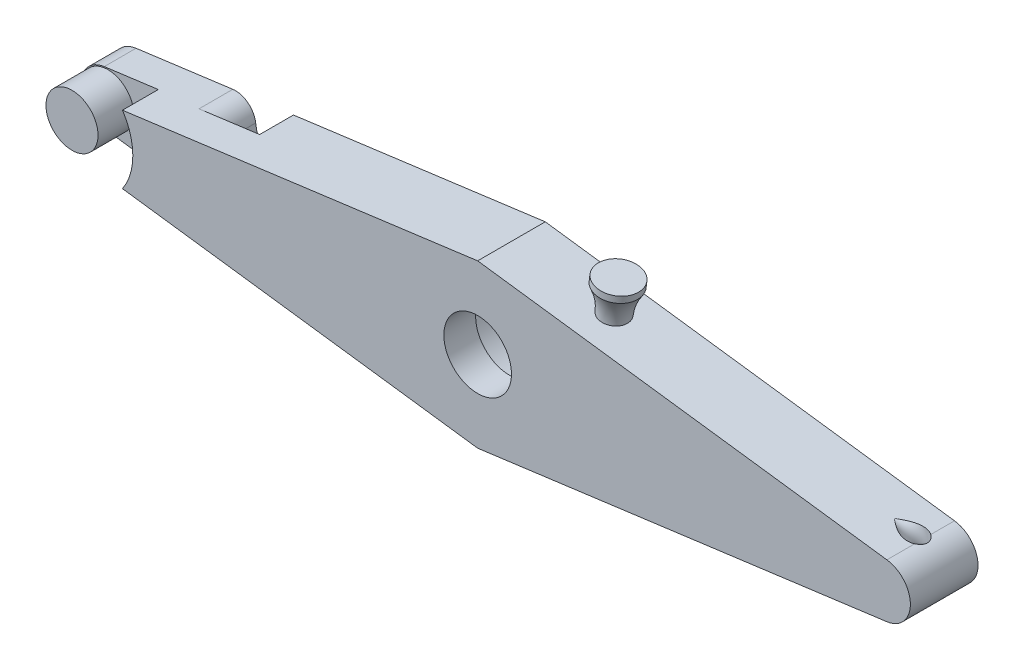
ISO-10303-21;
HEADER;
FILE_DESCRIPTION(('STEP AP214'),'2;1');
FILE_NAME('part.step','',(''),(''),'','','');
FILE_SCHEMA(('AUTOMOTIVE_DESIGN { 1 0 10303 214 1 1 1 1 }'));
ENDSEC;
DATA;
#1=APPLICATION_CONTEXT('core data for automotive mechanical design processes');
#2=APPLICATION_PROTOCOL_DEFINITION('international standard','automotive_design',2000,#1);
#3=PRODUCT_CONTEXT('',#1,'mechanical');
#4=PRODUCT('Part','Part','',(#3));
#5=PRODUCT_RELATED_PRODUCT_CATEGORY('part','',(#4));
#6=PRODUCT_DEFINITION_FORMATION('','',#4);
#7=PRODUCT_DEFINITION_CONTEXT('part definition',#1,'design');
#8=PRODUCT_DEFINITION('design','',#6,#7);
#9=PRODUCT_DEFINITION_SHAPE('','',#8);
#10=(LENGTH_UNIT() NAMED_UNIT(*) SI_UNIT(.MILLI.,.METRE.));
#11=(NAMED_UNIT(*) PLANE_ANGLE_UNIT() SI_UNIT($,.RADIAN.));
#12=(NAMED_UNIT(*) SI_UNIT($,.STERADIAN.) SOLID_ANGLE_UNIT());
#13=UNCERTAINTY_MEASURE_WITH_UNIT(LENGTH_MEASURE(1.E-05),#10,'distance_accuracy_value','');
#14=(GEOMETRIC_REPRESENTATION_CONTEXT(3) GLOBAL_UNCERTAINTY_ASSIGNED_CONTEXT((#13)) GLOBAL_UNIT_ASSIGNED_CONTEXT((#10,
#11,#12)) REPRESENTATION_CONTEXT('',''));
#15=CARTESIAN_POINT('',(0.,0.,0.));
#16=DIRECTION('',(0.,0.,1.));
#17=DIRECTION('',(1.,0.,0.));
#18=AXIS2_PLACEMENT_3D('',#15,#16,#17);
#19=CARTESIAN_POINT('',(60.5263762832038,3.96521474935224,10.));
#20=DIRECTION('',(-0.131594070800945,-0.991303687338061,0.));
#21=DIRECTION('',(0.991303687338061,-0.131594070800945,0.));
#22=AXIS2_PLACEMENT_3D('',#19,#20,#21);
#23=PLANE('',#22);
#24=CARTESIAN_POINT('',(14.8695553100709,10.0260889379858,4.7));
#25=DIRECTION('',(-0.131594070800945,-0.991303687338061,0.));
#26=DIRECTION('',(0.991303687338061,-0.131594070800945,0.));
#27=AXIS2_PLACEMENT_3D('',#24,#25,#26);
#28=CIRCLE('',#27,2.);
#29=CARTESIAN_POINT('',(16.852162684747,9.76290079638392,4.7));
#30=VERTEX_POINT('',#29);
#31=EDGE_CURVE('E268',#30,#30,#28,.T.);
#32=ORIENTED_EDGE('',*,*,#31,.T.);
#33=EDGE_LOOP('',(#32));
#34=FACE_BOUND('',#33,.T.);
#35=CARTESIAN_POINT('',(56.3289851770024,4.52241209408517,4.7));
#36=CARTESIAN_POINT('',(56.3315975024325,4.52206531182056,4.70204123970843));
#37=CARTESIAN_POINT('',(56.334209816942,4.52171853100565,4.70408248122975));
#38=CARTESIAN_POINT('',(56.6134100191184,4.48465512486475,4.92224615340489));
#39=CARTESIAN_POINT('',(56.8899879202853,4.44793982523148,5.13824358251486));
#40=CARTESIAN_POINT('',(57.4657737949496,4.37150511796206,5.53840701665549));
#41=CARTESIAN_POINT('',(57.7648863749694,4.33179837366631,5.72269743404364));
#42=CARTESIAN_POINT('',(58.2179215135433,4.27165864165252,5.93415983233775));
#43=CARTESIAN_POINT('',(58.3578106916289,4.2530885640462,5.99111846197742));
#44=CARTESIAN_POINT('',(58.6438202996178,4.21512121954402,6.08710910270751));
#45=CARTESIAN_POINT('',(58.7899477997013,4.19572301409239,6.12612015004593));
#46=CARTESIAN_POINT('',(59.0884385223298,4.15609882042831,6.18162566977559));
#47=CARTESIAN_POINT('',(59.240854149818,4.13586587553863,6.19785588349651));
#48=CARTESIAN_POINT('',(59.469579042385,4.10550299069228,6.20077538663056));
#49=CARTESIAN_POINT('',(59.54581042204,4.09538338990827,6.19818231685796));
#50=CARTESIAN_POINT('',(59.6976106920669,4.07523213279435,6.18527763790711));
#51=CARTESIAN_POINT('',(59.7731799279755,4.06520043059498,6.17497033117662));
#52=CARTESIAN_POINT('',(59.9483896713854,4.04194160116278,6.14114553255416));
#53=CARTESIAN_POINT('',(60.0474292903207,4.02879424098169,6.11431699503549));
#54=CARTESIAN_POINT('',(60.239772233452,4.00326100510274,6.0448375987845));
#55=CARTESIAN_POINT('',(60.3330892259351,3.99087331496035,6.00222630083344));
#56=CARTESIAN_POINT('',(60.4664698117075,3.9731672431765,5.92621906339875));
#57=CARTESIAN_POINT('',(60.5099356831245,3.96739721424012,5.89878064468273));
#58=CARTESIAN_POINT('',(60.5941369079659,3.95621962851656,5.83992170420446));
#59=CARTESIAN_POINT('',(60.6348729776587,3.95081197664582,5.80850223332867));
#60=CARTESIAN_POINT('',(60.7134721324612,3.94037805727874,5.74149666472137));
#61=CARTESIAN_POINT('',(60.7513057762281,3.93535569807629,5.70587532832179));
#62=CARTESIAN_POINT('',(60.8232152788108,3.92580981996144,5.63088543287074));
#63=CARTESIAN_POINT('',(60.857286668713,3.92128689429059,5.59151251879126));
#64=CARTESIAN_POINT('',(60.8891961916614,3.91705095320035,5.5503996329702));
#65=B_SPLINE_CURVE_WITH_KNOTS('',3,(#35,#36,#37,#38,#39,#40,#41,#42,#43,#44,#45,#46,#47,#48,#49,
#50,#51,#52,#53,#54,#55,#56,#57,#58,#59,#60,#61,#62,#63,#64),.UNSPECIFIED.,.F.,.F.,(4,2,2,2,2,2,
2,2,2,2,2,2,2,2,4),(0.,0.0100000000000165,1.06878515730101,2.12331608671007,2.57887119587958,
3.0349570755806,3.49629103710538,3.72679393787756,3.95716837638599,4.26628399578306,
4.57462997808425,4.72961473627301,4.88455866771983,5.04090932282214,5.19744374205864),.UNSPECIFIED.);
#66=CARTESIAN_POINT('',(56.3289851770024,4.52241209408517,4.7));
#67=VERTEX_POINT('',#66);
#68=CARTESIAN_POINT('',(60.5263762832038,3.96521474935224,5.88692845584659));
#69=VERTEX_POINT('',#68);
#70=EDGE_CURVE('E78',#67,#69,#65,.T.);
#71=ORIENTED_EDGE('',*,*,#70,.F.);
#72=CARTESIAN_POINT('',(56.3289851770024,4.52241209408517,4.7));
#73=CARTESIAN_POINT('',(56.3315975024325,4.52206531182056,4.69795876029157));
#74=CARTESIAN_POINT('',(56.334209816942,4.52171853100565,4.69591751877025));
#75=CARTESIAN_POINT('',(56.6134100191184,4.48465512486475,4.47775384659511));
#76=CARTESIAN_POINT('',(56.8899879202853,4.44793982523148,4.26175641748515));
#77=CARTESIAN_POINT('',(57.4657737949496,4.37150511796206,3.86159298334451));
#78=CARTESIAN_POINT('',(57.7648863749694,4.33179837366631,3.67730256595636));
#79=CARTESIAN_POINT('',(58.2179215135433,4.27165864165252,3.46584016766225));
#80=CARTESIAN_POINT('',(58.3578106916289,4.2530885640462,3.40888153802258));
#81=CARTESIAN_POINT('',(58.6438202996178,4.21512121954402,3.31289089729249));
#82=CARTESIAN_POINT('',(58.7899477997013,4.19572301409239,3.27387984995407));
#83=CARTESIAN_POINT('',(59.0884385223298,4.15609882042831,3.21837433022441));
#84=CARTESIAN_POINT('',(59.240854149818,4.13586587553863,3.20214411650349));
#85=CARTESIAN_POINT('',(59.469579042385,4.10550299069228,3.19922461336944));
#86=CARTESIAN_POINT('',(59.54581042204,4.09538338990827,3.20181768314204));
#87=CARTESIAN_POINT('',(59.6976106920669,4.07523213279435,3.21472236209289));
#88=CARTESIAN_POINT('',(59.7731799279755,4.06520043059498,3.22502966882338));
#89=CARTESIAN_POINT('',(59.9483896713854,4.04194160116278,3.25885446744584));
#90=CARTESIAN_POINT('',(60.0474292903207,4.02879424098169,3.28568300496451));
#91=CARTESIAN_POINT('',(60.239772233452,4.00326100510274,3.3551624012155));
#92=CARTESIAN_POINT('',(60.3330892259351,3.99087331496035,3.39777369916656));
#93=CARTESIAN_POINT('',(60.4664698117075,3.9731672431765,3.47378093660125));
#94=CARTESIAN_POINT('',(60.5099356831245,3.96739721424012,3.50121935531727));
#95=CARTESIAN_POINT('',(60.5941369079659,3.95621962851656,3.56007829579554));
#96=CARTESIAN_POINT('',(60.6348729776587,3.95081197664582,3.59149776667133));
#97=CARTESIAN_POINT('',(60.7134721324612,3.94037805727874,3.65850333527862));
#98=CARTESIAN_POINT('',(60.7513057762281,3.93535569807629,3.69412467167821));
#99=CARTESIAN_POINT('',(60.8232152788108,3.92580981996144,3.76911456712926));
#100=CARTESIAN_POINT('',(60.857286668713,3.92128689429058,3.80848748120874));
#101=CARTESIAN_POINT('',(60.8891961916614,3.91705095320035,3.8496003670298));
#102=B_SPLINE_CURVE_WITH_KNOTS('',3,(#72,#73,#74,#75,#76,#77,#78,#79,#80,#81,#82,#83,#84,#85,
#86,#87,#88,#89,#90,#91,#92,#93,#94,#95,#96,#97,#98,#99,#100,#101),.UNSPECIFIED.,.F.,.F.,(4,2,2,
2,2,2,2,2,2,2,2,2,2,2,4),(0.,0.0100000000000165,1.06878515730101,2.12331608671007,
2.57887119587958,3.0349570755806,3.49629103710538,3.72679393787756,3.95716837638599,
4.26628399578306,4.57462997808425,4.72961473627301,4.88455866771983,5.04090932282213,
5.19744374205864),.UNSPECIFIED.);
#103=CARTESIAN_POINT('',(60.5263762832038,3.96521474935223,3.51307154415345));
#104=VERTEX_POINT('',#103);
#105=EDGE_CURVE('E188',#104,#67,#102,.F.);
#106=ORIENTED_EDGE('',*,*,#105,.F.);
#107=DIRECTION('',(0.,0.,-1.));
#108=VECTOR('',#107,1.);
#109=CARTESIAN_POINT('',(60.5263762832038,3.96521474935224,10.));
#110=LINE('',#109,#108);
#111=CARTESIAN_POINT('',(60.5263762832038,3.96521474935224,0.));
#112=VERTEX_POINT('',#111);
#113=EDGE_CURVE('E512',#104,#112,#110,.T.);
#114=ORIENTED_EDGE('',*,*,#113,.T.);
#115=DIRECTION('',(-0.991303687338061,0.131594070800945,0.));
#116=VECTOR('',#115,1.);
#117=CARTESIAN_POINT('',(60.5263762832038,3.96521474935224,0.));
#118=LINE('',#117,#116);
#119=CARTESIAN_POINT('',(0.,12.,0.));
#120=VERTEX_POINT('',#119);
#121=EDGE_CURVE('E498',#112,#120,#118,.T.);
#122=ORIENTED_EDGE('',*,*,#121,.T.);
#123=DIRECTION('',(0.,0.,-1.));
#124=VECTOR('',#123,1.);
#125=CARTESIAN_POINT('',(0.,12.,10.));
#126=LINE('',#125,#124);
#127=CARTESIAN_POINT('',(0.,12.,10.));
#128=VERTEX_POINT('',#127);
#129=EDGE_CURVE('E542',#128,#120,#126,.T.);
#130=ORIENTED_EDGE('',*,*,#129,.F.);
#131=DIRECTION('',(-0.991303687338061,0.131594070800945,0.));
#132=VECTOR('',#131,1.);
#133=CARTESIAN_POINT('',(60.5263762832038,3.96521474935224,10.));
#134=LINE('',#133,#132);
#135=CARTESIAN_POINT('',(60.5263762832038,3.96521474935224,10.));
#136=VERTEX_POINT('',#135);
#137=EDGE_CURVE('E500',#136,#128,#134,.T.);
#138=ORIENTED_EDGE('',*,*,#137,.F.);
#139=EDGE_CURVE('E197',#136,#69,#110,.T.);
#140=ORIENTED_EDGE('',*,*,#139,.T.);
#141=EDGE_LOOP('',(#71,#106,#114,#122,#130,#138,#140));
#142=FACE_BOUND('',#141,.T.);
#143=ADVANCED_FACE('F51',(#34,#142),#23,.F.);
#144=CARTESIAN_POINT('',(60.,0.,10.));
#145=DIRECTION('',(0.,0.,-1.));
#146=DIRECTION('',(-1.,0.,0.));
#147=AXIS2_PLACEMENT_3D('',#144,#145,#146);
#148=CYLINDRICAL_SURFACE('',#147,4.);
#149=CARTESIAN_POINT('',(60.5263762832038,-3.96521474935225,3.29539044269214));
#150=CARTESIAN_POINT('',(60.5663465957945,-3.95991136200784,3.31036954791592));
#151=CARTESIAN_POINT('',(60.6055919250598,-3.95408352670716,3.32702300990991));
#152=CARTESIAN_POINT('',(60.6824005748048,-3.94155294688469,3.36353510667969));
#153=CARTESIAN_POINT('',(60.7199644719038,-3.93485050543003,3.38339263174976));
#154=CARTESIAN_POINT('',(60.8296665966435,-3.9137168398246,3.44747977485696));
#155=CARTESIAN_POINT('',(60.8989921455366,-3.89823454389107,3.4962907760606));
#156=CARTESIAN_POINT('',(61.0282277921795,-3.86616004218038,3.60461738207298));
#157=CARTESIAN_POINT('',(61.0881452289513,-3.84956871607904,3.6641245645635));
#158=CARTESIAN_POINT('',(61.1972786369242,-3.81703664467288,3.79246663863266));
#159=CARTESIAN_POINT('',(61.2464909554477,-3.80109612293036,3.86130470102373));
#160=CARTESIAN_POINT('',(61.3335931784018,-3.77143098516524,4.00795430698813));
#161=CARTESIAN_POINT('',(61.371270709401,-3.75774985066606,4.08590138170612));
#162=CARTESIAN_POINT('',(61.4327866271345,-3.73473054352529,4.24767353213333));
#163=CARTESIAN_POINT('',(61.4566324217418,-3.72539004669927,4.33149543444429));
#164=CARTESIAN_POINT('',(61.4886169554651,-3.71272171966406,4.49795500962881));
#165=CARTESIAN_POINT('',(61.4975127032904,-3.70910468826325,4.58042490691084));
#166=CARTESIAN_POINT('',(61.5015787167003,-3.70746127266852,4.74574652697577));
#167=CARTESIAN_POINT('',(61.4967529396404,-3.70943327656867,4.82859813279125));
#168=CARTESIAN_POINT('',(61.4741965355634,-3.71845071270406,4.98790649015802));
#169=CARTESIAN_POINT('',(61.4571329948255,-3.72523369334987,5.06447443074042));
#170=CARTESIAN_POINT('',(61.411486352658,-3.74276624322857,5.21360474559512));
#171=CARTESIAN_POINT('',(61.3829017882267,-3.75351631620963,5.28616660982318));
#172=CARTESIAN_POINT('',(61.3139711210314,-3.7782084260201,5.42794272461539));
#173=CARTESIAN_POINT('',(61.2732647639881,-3.79224490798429,5.49696479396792));
#174=CARTESIAN_POINT('',(61.1815689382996,-3.82180733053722,5.62750367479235));
#175=CARTESIAN_POINT('',(61.1305715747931,-3.83733440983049,5.6890146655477));
#176=CARTESIAN_POINT('',(61.0158227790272,-3.8693513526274,5.80693833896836));
#177=CARTESIAN_POINT('',(60.951454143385,-3.88583755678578,5.86275187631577));
#178=CARTESIAN_POINT('',(60.8139706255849,-3.91693602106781,5.96279455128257));
#179=CARTESIAN_POINT('',(60.7408729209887,-3.93155184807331,6.00704591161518));
#180=CARTESIAN_POINT('',(60.6419479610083,-3.94821827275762,6.05592556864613));
#181=CARTESIAN_POINT('',(60.6191911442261,-3.95185359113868,6.06646766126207));
#182=CARTESIAN_POINT('',(60.5731650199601,-3.95879030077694,6.08640116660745));
#183=CARTESIAN_POINT('',(60.5498964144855,-3.96209211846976,6.09579405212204));
#184=CARTESIAN_POINT('',(60.5263762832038,-3.96521474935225,6.10460955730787));
#185=B_SPLINE_CURVE_WITH_KNOTS('',3,(#149,#150,#151,#152,#153,#154,#155,#156,#157,#158,#159,
#160,#161,#162,#163,#164,#165,#166,#167,#168,#169,#170,#171,#172,#173,#174,#175,#176,#177,#178,
#179,#180,#181,#182,#183,#184),.UNSPECIFIED.,.F.,.F.,(4,2,2,2,2,2,2,2,2,2,2,2,2,2,2,2,2,4),(0.,
0.128949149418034,0.257853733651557,0.515098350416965,0.772141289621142,1.02927179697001,
1.29088552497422,1.55235901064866,1.80014249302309,2.04785452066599,2.28300004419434,
2.51817543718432,2.76118914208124,3.0043899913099,3.26354467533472,3.52219753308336,
3.59820057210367,3.67410516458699),.UNSPECIFIED.);
#186=CARTESIAN_POINT('',(60.5263762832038,-3.96521474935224,3.29539044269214));
#187=VERTEX_POINT('',#186);
#188=CARTESIAN_POINT('',(60.5263762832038,-3.96521474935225,6.10460955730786));
#189=VERTEX_POINT('',#188);
#190=EDGE_CURVE('E12',#187,#189,#185,.T.);
#191=ORIENTED_EDGE('',*,*,#190,.F.);
#192=DIRECTION('',(0.,0.,-1.));
#193=VECTOR('',#192,1.);
#194=CARTESIAN_POINT('',(60.5263762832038,-3.96521474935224,10.));
#195=LINE('',#194,#193);
#196=CARTESIAN_POINT('',(60.5263762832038,-3.96521474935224,0.));
#197=VERTEX_POINT('',#196);
#198=EDGE_CURVE('E530',#187,#197,#195,.T.);
#199=ORIENTED_EDGE('',*,*,#198,.T.);
#200=CARTESIAN_POINT('',(60.,0.,0.));
#201=DIRECTION('',(0.,0.,1.));
#202=DIRECTION('',(1.,0.,0.));
#203=AXIS2_PLACEMENT_3D('',#200,#201,#202);
#204=CIRCLE('',#203,4.);
#205=EDGE_CURVE('E504',#197,#112,#204,.T.);
#206=ORIENTED_EDGE('',*,*,#205,.T.);
#207=ORIENTED_EDGE('',*,*,#113,.F.);
#208=CARTESIAN_POINT('',(60.5261762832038,3.96524129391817,5.88706268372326));
#209=CARTESIAN_POINT('',(60.5635774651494,3.96028020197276,5.86195917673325));
#210=CARTESIAN_POINT('',(60.5999809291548,3.95490860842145,5.83548141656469));
#211=CARTESIAN_POINT('',(60.6705733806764,3.94355274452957,5.77980284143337));
#212=CARTESIAN_POINT('',(60.7047610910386,3.93756812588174,5.75060047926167));
#213=CARTESIAN_POINT('',(60.8041442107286,3.91891653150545,5.65849415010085));
#214=CARTESIAN_POINT('',(60.8655436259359,3.90563927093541,5.59149989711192));
#215=CARTESIAN_POINT('',(60.9758304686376,3.87956089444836,5.44730057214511));
#216=CARTESIAN_POINT('',(61.0246635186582,3.86676204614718,5.37005324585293));
#217=CARTESIAN_POINT('',(61.106411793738,3.84417290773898,5.20738816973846));
#218=CARTESIAN_POINT('',(61.1393925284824,3.83437029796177,5.12200582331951));
#219=CARTESIAN_POINT('',(61.1838225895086,3.82086845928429,4.95740716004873));
#220=CARTESIAN_POINT('',(61.1975322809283,3.81653633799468,4.87885557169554));
#221=CARTESIAN_POINT('',(61.2100016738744,3.81260386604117,4.7204235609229));
#222=CARTESIAN_POINT('',(61.2087642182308,3.8130026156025,4.64054339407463));
#223=CARTESIAN_POINT('',(61.1926244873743,3.81807453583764,4.49321570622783));
#224=CARTESIAN_POINT('',(61.1795722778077,3.82216878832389,4.42553446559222));
#225=CARTESIAN_POINT('',(61.1431324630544,3.83322425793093,4.29330008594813));
#226=CARTESIAN_POINT('',(61.1197464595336,3.84018503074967,4.22874646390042));
#227=CARTESIAN_POINT('',(61.0626209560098,3.85639039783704,4.1014915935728));
#228=CARTESIAN_POINT('',(61.0284946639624,3.86571725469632,4.03897617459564));
#229=CARTESIAN_POINT('',(60.9516243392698,3.8853554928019,3.91959359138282));
#230=CARTESIAN_POINT('',(60.9088688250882,3.89566817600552,3.86273410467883));
#231=CARTESIAN_POINT('',(60.8135162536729,3.91671908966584,3.75232325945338));
#232=CARTESIAN_POINT('',(60.7605048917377,3.92744920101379,3.69913025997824));
#233=CARTESIAN_POINT('',(60.6479325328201,3.94759389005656,3.60032758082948));
#234=CARTESIAN_POINT('',(60.5883950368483,3.95701292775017,3.5546920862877));
#235=CARTESIAN_POINT('',(60.5261762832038,3.96524129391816,3.51293731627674));
#236=B_SPLINE_CURVE_WITH_KNOTS('',3,(#208,#209,#210,#211,#212,#213,#214,#215,#216,#217,#218,
#219,#220,#221,#222,#223,#224,#225,#226,#227,#228,#229,#230,#231,#232,#233,#234,#235),
.UNSPECIFIED.,.F.,.F.,(4,2,2,2,2,2,2,2,2,2,2,2,2,4),(0.,0.135880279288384,0.27183819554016,
0.545962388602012,0.821253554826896,1.09539708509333,1.33350574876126,1.57156912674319,
1.77778712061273,1.9839731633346,2.1986522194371,2.4136188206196,2.64050749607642,
2.86660442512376),.UNSPECIFIED.);
#237=EDGE_CURVE('E65',#69,#104,#236,.T.);
#238=ORIENTED_EDGE('',*,*,#237,.F.);
#239=ORIENTED_EDGE('',*,*,#139,.F.);
#240=CARTESIAN_POINT('',(60.,0.,10.));
#241=DIRECTION('',(0.,0.,1.));
#242=DIRECTION('',(1.,0.,0.));
#243=AXIS2_PLACEMENT_3D('',#240,#241,#242);
#244=CIRCLE('',#243,4.);
#245=CARTESIAN_POINT('',(60.5263762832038,-3.96521474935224,10.));
#246=VERTEX_POINT('',#245);
#247=EDGE_CURVE('E510',#246,#136,#244,.T.);
#248=ORIENTED_EDGE('',*,*,#247,.F.);
#249=EDGE_CURVE('E531',#246,#189,#195,.T.);
#250=ORIENTED_EDGE('',*,*,#249,.T.);
#251=EDGE_LOOP('',(#191,#199,#206,#207,#238,#239,#248,#250));
#252=FACE_BOUND('',#251,.T.);
#253=ADVANCED_FACE('F232',(#252),#148,.T.);
#254=CARTESIAN_POINT('',(-60.,0.,0.));
#255=DIRECTION('',(0.,0.,1.));
#256=DIRECTION('',(1.,0.,0.));
#257=AXIS2_PLACEMENT_3D('',#254,#255,#256);
#258=PLANE('',#257);
#259=CARTESIAN_POINT('',(0.,0.,0.));
#260=DIRECTION('',(0.,0.,1.));
#261=DIRECTION('',(1.,0.,0.));
#262=AXIS2_PLACEMENT_3D('',#259,#260,#261);
#263=CIRCLE('',#262,8.1);
#264=CARTESIAN_POINT('',(8.1,0.,0.));
#265=VERTEX_POINT('',#264);
#266=EDGE_CURVE('E485',#265,#265,#263,.T.);
#267=ORIENTED_EDGE('',*,*,#266,.T.);
#268=EDGE_LOOP('',(#267));
#269=FACE_BOUND('',#268,.T.);
#270=DIRECTION('',(-0.991303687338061,-0.131594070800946,0.));
#271=VECTOR('',#270,1.);
#272=CARTESIAN_POINT('',(0.,12.,0.));
#273=LINE('',#272,#271);
#274=CARTESIAN_POINT('',(-46.2107498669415,5.86559258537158,0.));
#275=VERTEX_POINT('',#274);
#276=CARTESIAN_POINT('',(-60.5263762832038,3.96521474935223,0.));
#277=VERTEX_POINT('',#276);
#278=EDGE_CURVE('E515',#275,#277,#273,.T.);
#279=ORIENTED_EDGE('',*,*,#278,.F.);
#280=CARTESIAN_POINT('',(-45.8159676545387,2.89168152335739,0.));
#281=DIRECTION('',(0.,0.,1.));
#282=DIRECTION('',(1.,0.,0.));
#283=AXIS2_PLACEMENT_3D('',#280,#281,#282);
#284=CIRCLE('',#283,3.);
#285=CARTESIAN_POINT('',(-42.8360277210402,3.23803104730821,0.));
#286=VERTEX_POINT('',#285);
#287=EDGE_CURVE('E551',#275,#286,#284,.F.);
#288=ORIENTED_EDGE('',*,*,#287,.T.);
#289=CARTESIAN_POINT('',(-36.2801598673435,4.,0.));
#290=DIRECTION('',(0.,0.,-1.));
#291=DIRECTION('',(-1.,0.,0.));
#292=AXIS2_PLACEMENT_3D('',#289,#290,#291);
#293=CIRCLE('',#292,6.59999999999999);
#294=CARTESIAN_POINT('',(-36.2801598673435,-2.59999999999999,0.));
#295=VERTEX_POINT('',#294);
#296=EDGE_CURVE('E616',#295,#286,#293,.T.);
#297=ORIENTED_EDGE('',*,*,#296,.F.);
#298=DIRECTION('',(-1.,0.,0.));
#299=VECTOR('',#298,1.);
#300=CARTESIAN_POINT('',(-30.2801598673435,-2.6,0.));
#301=LINE('',#300,#299);
#302=CARTESIAN_POINT('',(-30.2801598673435,-2.6,0.));
#303=VERTEX_POINT('',#302);
#304=EDGE_CURVE('E618',#303,#295,#301,.T.);
#305=ORIENTED_EDGE('',*,*,#304,.F.);
#306=CARTESIAN_POINT('',(-30.2801598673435,0.,0.));
#307=DIRECTION('',(0.,0.,-1.));
#308=DIRECTION('',(-1.,0.,0.));
#309=AXIS2_PLACEMENT_3D('',#306,#307,#308);
#310=CIRCLE('',#309,2.6);
#311=CARTESIAN_POINT('',(-30.2801598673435,2.6,0.));
#312=VERTEX_POINT('',#311);
#313=EDGE_CURVE('E621',#312,#303,#310,.T.);
#314=ORIENTED_EDGE('',*,*,#313,.F.);
#315=DIRECTION('',(1.,0.,0.));
#316=VECTOR('',#315,1.);
#317=CARTESIAN_POINT('',(-30.2801598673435,2.6,0.));
#318=LINE('',#317,#316);
#319=CARTESIAN_POINT('',(-36.2801598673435,2.6,0.));
#320=VERTEX_POINT('',#319);
#321=EDGE_CURVE('E624',#320,#312,#318,.T.);
#322=ORIENTED_EDGE('',*,*,#321,.F.);
#323=CARTESIAN_POINT('',(-36.2801598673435,4.,0.));
#324=DIRECTION('',(0.,0.,1.));
#325=DIRECTION('',(-1.,0.,0.));
#326=AXIS2_PLACEMENT_3D('',#323,#324,#325);
#327=CIRCLE('',#326,1.4);
#328=CARTESIAN_POINT('',(-37.6717276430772,4.15342465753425,0.));
#329=VERTEX_POINT('',#328);
#330=EDGE_CURVE('E627',#329,#320,#327,.T.);
#331=ORIENTED_EDGE('',*,*,#330,.F.);
#332=CARTESIAN_POINT('',(0.,0.,0.));
#333=DIRECTION('',(0.,0.,1.));
#334=DIRECTION('',(1.,0.,0.));
#335=AXIS2_PLACEMENT_3D('',#332,#333,#334);
#336=CIRCLE('',#335,37.9);
#337=CARTESIAN_POINT('',(-37.3781415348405,6.26773766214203,0.));
#338=VERTEX_POINT('',#337);
#339=EDGE_CURVE('E199',#338,#329,#336,.T.);
#340=ORIENTED_EDGE('',*,*,#339,.F.);
#341=DIRECTION('',(-0.165375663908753,-0.98623064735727,0.));
#342=VECTOR('',#341,1.);
#343=CARTESIAN_POINT('',(-37.3781415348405,6.26773766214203,0.));
#344=LINE('',#343,#342);
#345=CARTESIAN_POINT('',(-37.2460213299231,7.05564679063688,0.));
#346=VERTEX_POINT('',#345);
#347=EDGE_CURVE('E612',#346,#338,#344,.T.);
#348=ORIENTED_EDGE('',*,*,#347,.F.);
#349=EDGE_CURVE('E516',#120,#346,#273,.T.);
#350=ORIENTED_EDGE('',*,*,#349,.F.);
#351=ORIENTED_EDGE('',*,*,#121,.F.);
#352=ORIENTED_EDGE('',*,*,#205,.F.);
#353=DIRECTION('',(0.991303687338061,0.131594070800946,0.));
#354=VECTOR('',#353,1.);
#355=CARTESIAN_POINT('',(0.,-12.,0.));
#356=LINE('',#355,#354);
#357=CARTESIAN_POINT('',(0.,-12.,0.));
#358=VERTEX_POINT('',#357);
#359=EDGE_CURVE('E524',#358,#197,#356,.T.);
#360=ORIENTED_EDGE('',*,*,#359,.F.);
#361=DIRECTION('',(0.991303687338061,-0.131594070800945,0.));
#362=VECTOR('',#361,1.);
#363=CARTESIAN_POINT('',(-60.5263762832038,-3.96521474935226,0.));
#364=LINE('',#363,#362);
#365=CARTESIAN_POINT('',(-60.5263762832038,-3.96521474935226,0.));
#366=VERTEX_POINT('',#365);
#367=EDGE_CURVE('E522',#366,#358,#364,.T.);
#368=ORIENTED_EDGE('',*,*,#367,.F.);
#369=CARTESIAN_POINT('',(-60.,0.,0.));
#370=DIRECTION('',(0.,0.,1.));
#371=DIRECTION('',(1.,0.,0.));
#372=AXIS2_PLACEMENT_3D('',#369,#370,#371);
#373=CIRCLE('',#372,4.);
#374=EDGE_CURVE('E519',#277,#366,#373,.T.);
#375=ORIENTED_EDGE('',*,*,#374,.F.);
#376=EDGE_LOOP('',(#279,#288,#297,#305,#314,#322,#331,#340,#348,#350,#351,#352,#360,#368,#375));
#377=FACE_BOUND('',#376,.T.);
#378=ADVANCED_FACE('F237',(#269,#377),#258,.F.);
#379=CARTESIAN_POINT('',(-60.,0.,10.));
#380=DIRECTION('',(0.,0.,-1.));
#381=DIRECTION('',(-1.,0.,0.));
#382=AXIS2_PLACEMENT_3D('',#379,#380,#381);
#383=CYLINDRICAL_SURFACE('',#382,4.);
#384=CARTESIAN_POINT('',(-60.,0.,4.7));
#385=DIRECTION('',(0.,0.,1.));
#386=DIRECTION('',(1.,0.,0.));
#387=AXIS2_PLACEMENT_3D('',#384,#385,#386);
#388=CIRCLE('',#387,4.);
#389=CARTESIAN_POINT('',(-60.5263762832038,3.96521474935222,4.7));
#390=VERTEX_POINT('',#389);
#391=CARTESIAN_POINT('',(-60.5263762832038,-3.96521474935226,4.7));
#392=VERTEX_POINT('',#391);
#393=EDGE_CURVE('E576',#390,#392,#388,.T.);
#394=ORIENTED_EDGE('',*,*,#393,.F.);
#395=DIRECTION('',(0.,0.,-1.));
#396=VECTOR('',#395,1.);
#397=CARTESIAN_POINT('',(-60.5263762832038,3.96521474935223,10.));
#398=LINE('',#397,#396);
#399=EDGE_CURVE('E539',#390,#277,#398,.T.);
#400=ORIENTED_EDGE('',*,*,#399,.T.);
#401=ORIENTED_EDGE('',*,*,#374,.T.);
#402=DIRECTION('',(0.,0.,-1.));
#403=VECTOR('',#402,1.);
#404=CARTESIAN_POINT('',(-60.5263762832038,-3.96521474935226,10.));
#405=LINE('',#404,#403);
#406=EDGE_CURVE('E537',#392,#366,#405,.T.);
#407=ORIENTED_EDGE('',*,*,#406,.F.);
#408=EDGE_LOOP('',(#394,#400,#401,#407));
#409=FACE_BOUND('',#408,.T.);
#410=ADVANCED_FACE('F251',(#409),#383,.T.);
#411=CARTESIAN_POINT('',(0.,12.,10.));
#412=DIRECTION('',(0.131594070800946,-0.991303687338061,0.));
#413=DIRECTION('',(0.991303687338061,0.131594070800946,0.));
#414=AXIS2_PLACEMENT_3D('',#411,#412,#413);
#415=PLANE('',#414);
#416=DIRECTION('',(0.991303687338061,0.131594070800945,0.));
#417=VECTOR('',#416,1.);
#418=CARTESIAN_POINT('',(-37.2460213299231,7.05564679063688,5.));
#419=LINE('',#418,#417);
#420=CARTESIAN_POINT('',(-46.2107498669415,5.86559258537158,5.));
#421=VERTEX_POINT('',#420);
#422=CARTESIAN_POINT('',(-37.2460213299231,7.05564679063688,5.));
#423=VERTEX_POINT('',#422);
#424=EDGE_CURVE('E562',#421,#423,#419,.T.);
#425=ORIENTED_EDGE('',*,*,#424,.F.);
#426=DIRECTION('',(0.,0.,-1.));
#427=VECTOR('',#426,1.);
#428=CARTESIAN_POINT('',(-46.2107498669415,5.86559258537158,10.));
#429=LINE('',#428,#427);
#430=EDGE_CURVE('E548',#421,#275,#429,.T.);
#431=ORIENTED_EDGE('',*,*,#430,.T.);
#432=ORIENTED_EDGE('',*,*,#278,.T.);
#433=ORIENTED_EDGE('',*,*,#399,.F.);
#434=DIRECTION('',(-0.991303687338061,-0.131594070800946,0.));
#435=VECTOR('',#434,1.);
#436=CARTESIAN_POINT('',(0.,12.,4.7));
#437=LINE('',#436,#435);
#438=CARTESIAN_POINT('',(-52.5342304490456,5.0261600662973,4.7));
#439=VERTEX_POINT('',#438);
#440=EDGE_CURVE('E492',#439,#390,#437,.T.);
#441=ORIENTED_EDGE('',*,*,#440,.F.);
#442=DIRECTION('',(0.,0.,1.));
#443=VECTOR('',#442,1.);
#444=CARTESIAN_POINT('',(-52.5342304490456,5.0261600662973,4.7));
#445=LINE('',#444,#443);
#446=CARTESIAN_POINT('',(-52.5342304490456,5.0261600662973,10.));
#447=VERTEX_POINT('',#446);
#448=EDGE_CURVE('E579',#439,#447,#445,.T.);
#449=ORIENTED_EDGE('',*,*,#448,.T.);
#450=DIRECTION('',(-0.991303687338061,-0.131594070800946,0.));
#451=VECTOR('',#450,1.);
#452=CARTESIAN_POINT('',(0.,12.,10.));
#453=LINE('',#452,#451);
#454=EDGE_CURVE('E503',#128,#447,#453,.T.);
#455=ORIENTED_EDGE('',*,*,#454,.F.);
#456=ORIENTED_EDGE('',*,*,#129,.T.);
#457=ORIENTED_EDGE('',*,*,#349,.T.);
#458=DIRECTION('',(0.,0.,-1.));
#459=VECTOR('',#458,1.);
#460=CARTESIAN_POINT('',(-37.2460213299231,7.05564679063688,5.));
#461=LINE('',#460,#459);
#462=EDGE_CURVE('E609',#423,#346,#461,.T.);
#463=ORIENTED_EDGE('',*,*,#462,.F.);
#464=EDGE_LOOP('',(#425,#431,#432,#433,#441,#449,#455,#456,#457,#463));
#465=FACE_BOUND('',#464,.T.);
#466=ADVANCED_FACE('F249',(#465),#415,.F.);
#467=CARTESIAN_POINT('',(-60.5263762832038,-3.96521474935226,10.));
#468=DIRECTION('',(0.131594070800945,0.991303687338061,0.));
#469=DIRECTION('',(-0.991303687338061,0.131594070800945,0.));
#470=AXIS2_PLACEMENT_3D('',#467,#468,#469);
#471=PLANE('',#470);
#472=DIRECTION('',(0.991303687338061,-0.131594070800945,0.));
#473=VECTOR('',#472,1.);
#474=CARTESIAN_POINT('',(-60.5263762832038,-3.96521474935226,10.));
#475=LINE('',#474,#473);
#476=CARTESIAN_POINT('',(-52.5342304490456,-5.02616006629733,10.));
#477=VERTEX_POINT('',#476);
#478=CARTESIAN_POINT('',(0.,-12.,10.));
#479=VERTEX_POINT('',#478);
#480=EDGE_CURVE('E506',#477,#479,#475,.T.);
#481=ORIENTED_EDGE('',*,*,#480,.F.);
#482=DIRECTION('',(0.,0.,1.));
#483=VECTOR('',#482,1.);
#484=CARTESIAN_POINT('',(-52.5342304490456,-5.02616006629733,4.7));
#485=LINE('',#484,#483);
#486=CARTESIAN_POINT('',(-52.5342304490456,-5.02616006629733,4.7));
#487=VERTEX_POINT('',#486);
#488=EDGE_CURVE('E583',#477,#487,#485,.F.);
#489=ORIENTED_EDGE('',*,*,#488,.T.);
#490=DIRECTION('',(0.991303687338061,-0.131594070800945,0.));
#491=VECTOR('',#490,1.);
#492=CARTESIAN_POINT('',(-60.5263762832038,-3.96521474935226,4.7));
#493=LINE('',#492,#491);
#494=EDGE_CURVE('E546',#392,#487,#493,.T.);
#495=ORIENTED_EDGE('',*,*,#494,.F.);
#496=ORIENTED_EDGE('',*,*,#406,.T.);
#497=ORIENTED_EDGE('',*,*,#367,.T.);
#498=DIRECTION('',(0.,0.,-1.));
#499=VECTOR('',#498,1.);
#500=CARTESIAN_POINT('',(0.,-12.,10.));
#501=LINE('',#500,#499);
#502=EDGE_CURVE('E534',#479,#358,#501,.T.);
#503=ORIENTED_EDGE('',*,*,#502,.F.);
#504=EDGE_LOOP('',(#481,#489,#495,#496,#497,#503));
#505=FACE_BOUND('',#504,.T.);
#506=ADVANCED_FACE('F245',(#505),#471,.F.);
#507=CARTESIAN_POINT('',(0.,-12.,10.));
#508=DIRECTION('',(-0.131594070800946,0.991303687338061,0.));
#509=DIRECTION('',(-0.991303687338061,-0.131594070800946,0.));
#510=AXIS2_PLACEMENT_3D('',#507,#508,#509);
#511=PLANE('',#510);
#512=CARTESIAN_POINT('',(60.,-4.03509040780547,4.7));
#513=DIRECTION('',(-0.131594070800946,0.991303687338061,0.));
#514=DIRECTION('',(0.991303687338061,0.131594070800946,0.));
#515=AXIS2_PLACEMENT_3D('',#512,#513,#514);
#516=ELLIPSE('',#515,1.51315890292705,1.5);
#517=EDGE_CURVE('E70',#189,#187,#516,.F.);
#518=ORIENTED_EDGE('',*,*,#517,.F.);
#519=ORIENTED_EDGE('',*,*,#249,.F.);
#520=DIRECTION('',(0.991303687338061,0.131594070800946,0.));
#521=VECTOR('',#520,1.);
#522=CARTESIAN_POINT('',(0.,-12.,10.));
#523=LINE('',#522,#521);
#524=EDGE_CURVE('E508',#479,#246,#523,.T.);
#525=ORIENTED_EDGE('',*,*,#524,.F.);
#526=ORIENTED_EDGE('',*,*,#502,.T.);
#527=ORIENTED_EDGE('',*,*,#359,.T.);
#528=ORIENTED_EDGE('',*,*,#198,.F.);
#529=EDGE_LOOP('',(#518,#519,#525,#526,#527,#528));
#530=FACE_BOUND('',#529,.T.);
#531=ADVANCED_FACE('F240',(#530),#511,.F.);
#532=CARTESIAN_POINT('',(-60.,0.,10.));
#533=DIRECTION('',(0.,0.,1.));
#534=DIRECTION('',(1.,0.,0.));
#535=AXIS2_PLACEMENT_3D('',#532,#533,#534);
#536=PLANE('',#535);
#537=CARTESIAN_POINT('',(-60.,0.,10.));
#538=DIRECTION('',(0.,0.,1.));
#539=DIRECTION('',(1.,0.,0.));
#540=AXIS2_PLACEMENT_3D('',#537,#538,#539);
#541=CIRCLE('',#540,9.);
#542=EDGE_CURVE('E480',#477,#447,#541,.T.);
#543=ORIENTED_EDGE('',*,*,#542,.F.);
#544=ORIENTED_EDGE('',*,*,#480,.T.);
#545=ORIENTED_EDGE('',*,*,#524,.T.);
#546=ORIENTED_EDGE('',*,*,#247,.T.);
#547=ORIENTED_EDGE('',*,*,#137,.T.);
#548=ORIENTED_EDGE('',*,*,#454,.T.);
#549=EDGE_LOOP('',(#543,#544,#545,#546,#547,#548));
#550=FACE_BOUND('',#549,.T.);
#551=CARTESIAN_POINT('',(0.,0.,10.));
#552=DIRECTION('',(0.,0.,-1.));
#553=DIRECTION('',(-1.,0.,0.));
#554=AXIS2_PLACEMENT_3D('',#551,#552,#553);
#555=CIRCLE('',#554,5.);
#556=CARTESIAN_POINT('',(-5.,0.,10.));
#557=VERTEX_POINT('',#556);
#558=EDGE_CURVE('E484',#557,#557,#555,.T.);
#559=ORIENTED_EDGE('',*,*,#558,.T.);
#560=EDGE_LOOP('',(#559));
#561=FACE_BOUND('',#560,.T.);
#562=ADVANCED_FACE('F244',(#550,#561),#536,.T.);
#563=CARTESIAN_POINT('',(0.,0.,5.3));
#564=DIRECTION('',(0.,0.,-1.));
#565=DIRECTION('',(-1.,0.,0.));
#566=AXIS2_PLACEMENT_3D('',#563,#564,#565);
#567=CYLINDRICAL_SURFACE('',#566,8.1);
#568=CARTESIAN_POINT('',(0.,0.,5.3));
#569=DIRECTION('',(0.,0.,1.));
#570=DIRECTION('',(1.,0.,0.));
#571=AXIS2_PLACEMENT_3D('',#568,#569,#570);
#572=CIRCLE('',#571,8.1);
#573=CARTESIAN_POINT('',(8.1,0.,5.3));
#574=VERTEX_POINT('',#573);
#575=EDGE_CURVE('E489',#574,#574,#572,.T.);
#576=ORIENTED_EDGE('',*,*,#575,.T.);
#577=EDGE_LOOP('',(#576));
#578=FACE_BOUND('',#577,.T.);
#579=ORIENTED_EDGE('',*,*,#266,.F.);
#580=EDGE_LOOP('',(#579));
#581=FACE_BOUND('',#580,.T.);
#582=ADVANCED_FACE('F452',(#578,#581),#567,.F.);
#583=CARTESIAN_POINT('',(0.,0.,5.3));
#584=DIRECTION('',(0.,0.,1.));
#585=DIRECTION('',(1.,0.,0.));
#586=AXIS2_PLACEMENT_3D('',#583,#584,#585);
#587=PLANE('',#586);
#588=CARTESIAN_POINT('',(0.,0.,5.3));
#589=DIRECTION('',(0.,0.,-1.));
#590=DIRECTION('',(-1.,0.,0.));
#591=AXIS2_PLACEMENT_3D('',#588,#589,#590);
#592=CIRCLE('',#591,5.);
#593=CARTESIAN_POINT('',(-5.,0.,5.3));
#594=VERTEX_POINT('',#593);
#595=EDGE_CURVE('E486',#594,#594,#592,.T.);
#596=ORIENTED_EDGE('',*,*,#595,.F.);
#597=EDGE_LOOP('',(#596));
#598=FACE_BOUND('',#597,.T.);
#599=ORIENTED_EDGE('',*,*,#575,.F.);
#600=EDGE_LOOP('',(#599));
#601=FACE_BOUND('',#600,.T.);
#602=ADVANCED_FACE('F444',(#598,#601),#587,.F.);
#603=CARTESIAN_POINT('',(0.,0.,10.));
#604=DIRECTION('',(0.,0.,-1.));
#605=DIRECTION('',(-1.,0.,0.));
#606=AXIS2_PLACEMENT_3D('',#603,#604,#605);
#607=CYLINDRICAL_SURFACE('',#606,5.);
#608=ORIENTED_EDGE('',*,*,#558,.F.);
#609=EDGE_LOOP('',(#608));
#610=FACE_BOUND('',#609,.T.);
#611=ORIENTED_EDGE('',*,*,#595,.T.);
#612=EDGE_LOOP('',(#611));
#613=FACE_BOUND('',#612,.T.);
#614=ADVANCED_FACE('F426',(#610,#613),#607,.F.);
#615=CARTESIAN_POINT('',(-60.,0.,4.7));
#616=DIRECTION('',(0.,0.,1.));
#617=DIRECTION('',(1.,0.,0.));
#618=AXIS2_PLACEMENT_3D('',#615,#616,#617);
#619=PLANE('',#618);
#620=CARTESIAN_POINT('',(-60.,0.,4.7));
#621=DIRECTION('',(0.,0.,1.));
#622=DIRECTION('',(1.,0.,0.));
#623=AXIS2_PLACEMENT_3D('',#620,#621,#622);
#624=CIRCLE('',#623,3.85);
#625=CARTESIAN_POINT('',(-56.15,0.,4.7));
#626=VERTEX_POINT('',#625);
#627=EDGE_CURVE('E590',#626,#626,#624,.T.);
#628=ORIENTED_EDGE('',*,*,#627,.F.);
#629=EDGE_LOOP('',(#628));
#630=FACE_BOUND('',#629,.T.);
#631=ORIENTED_EDGE('',*,*,#440,.T.);
#632=ORIENTED_EDGE('',*,*,#393,.T.);
#633=ORIENTED_EDGE('',*,*,#494,.T.);
#634=CARTESIAN_POINT('',(-60.,0.,4.7));
#635=DIRECTION('',(0.,0.,1.));
#636=DIRECTION('',(1.,0.,0.));
#637=AXIS2_PLACEMENT_3D('',#634,#635,#636);
#638=CIRCLE('',#637,9.);
#639=EDGE_CURVE('E588',#487,#439,#638,.T.);
#640=ORIENTED_EDGE('',*,*,#639,.T.);
#641=EDGE_LOOP('',(#631,#632,#633,#640));
#642=FACE_BOUND('',#641,.T.);
#643=ADVANCED_FACE('F418',(#630,#642),#619,.T.);
#644=CARTESIAN_POINT('',(-60.,0.,4.7));
#645=DIRECTION('',(0.,0.,1.));
#646=DIRECTION('',(1.,0.,0.));
#647=AXIS2_PLACEMENT_3D('',#644,#645,#646);
#648=CYLINDRICAL_SURFACE('',#647,9.);
#649=ORIENTED_EDGE('',*,*,#639,.F.);
#650=ORIENTED_EDGE('',*,*,#488,.F.);
#651=ORIENTED_EDGE('',*,*,#542,.T.);
#652=ORIENTED_EDGE('',*,*,#448,.F.);
#653=EDGE_LOOP('',(#649,#650,#651,#652));
#654=FACE_BOUND('',#653,.T.);
#655=ADVANCED_FACE('F410',(#654),#648,.F.);
#656=CARTESIAN_POINT('',(-60.,0.,4.7));
#657=DIRECTION('',(0.,0.,1.));
#658=DIRECTION('',(1.,0.,0.));
#659=AXIS2_PLACEMENT_3D('',#656,#657,#658);
#660=CYLINDRICAL_SURFACE('',#659,3.85);
#661=ORIENTED_EDGE('',*,*,#627,.T.);
#662=EDGE_LOOP('',(#661));
#663=FACE_BOUND('',#662,.T.);
#664=CARTESIAN_POINT('',(-60.,0.,10.));
#665=DIRECTION('',(0.,0.,1.));
#666=DIRECTION('',(1.,0.,0.));
#667=AXIS2_PLACEMENT_3D('',#664,#665,#666);
#668=CIRCLE('',#667,3.85);
#669=CARTESIAN_POINT('',(-56.15,0.,10.));
#670=VERTEX_POINT('',#669);
#671=EDGE_CURVE('E591',#670,#670,#668,.T.);
#672=ORIENTED_EDGE('',*,*,#671,.F.);
#673=EDGE_LOOP('',(#672));
#674=FACE_BOUND('',#673,.T.);
#675=ADVANCED_FACE('F405',(#663,#674),#660,.T.);
#676=ORIENTED_EDGE('',*,*,#671,.T.);
#677=EDGE_LOOP('',(#676));
#678=FACE_BOUND('',#677,.T.);
#679=ADVANCED_FACE('F395',(#678),#536,.T.);
#680=CARTESIAN_POINT('',(0.,0.,5.));
#681=DIRECTION('',(0.,0.,-1.));
#682=DIRECTION('',(-1.,0.,0.));
#683=AXIS2_PLACEMENT_3D('',#680,#681,#682);
#684=CYLINDRICAL_SURFACE('',#683,37.9);
#685=ORIENTED_EDGE('',*,*,#339,.T.);
#686=DIRECTION('',(0.,0.,-1.));
#687=VECTOR('',#686,1.);
#688=CARTESIAN_POINT('',(-37.6717276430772,4.15342465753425,5.));
#689=LINE('',#688,#687);
#690=CARTESIAN_POINT('',(-37.6717276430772,4.15342465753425,5.));
#691=VERTEX_POINT('',#690);
#692=EDGE_CURVE('E597',#691,#329,#689,.T.);
#693=ORIENTED_EDGE('',*,*,#692,.F.);
#694=CARTESIAN_POINT('',(0.,0.,5.));
#695=DIRECTION('',(0.,0.,1.));
#696=DIRECTION('',(1.,0.,0.));
#697=AXIS2_PLACEMENT_3D('',#694,#695,#696);
#698=CIRCLE('',#697,37.9);
#699=CARTESIAN_POINT('',(-37.3781415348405,6.26773766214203,5.));
#700=VERTEX_POINT('',#699);
#701=EDGE_CURVE('E615',#700,#691,#698,.T.);
#702=ORIENTED_EDGE('',*,*,#701,.F.);
#703=DIRECTION('',(0.,0.,-1.));
#704=VECTOR('',#703,1.);
#705=CARTESIAN_POINT('',(-37.3781415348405,6.26773766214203,5.));
#706=LINE('',#705,#704);
#707=EDGE_CURVE('E594',#700,#338,#706,.T.);
#708=ORIENTED_EDGE('',*,*,#707,.T.);
#709=EDGE_LOOP('',(#685,#693,#702,#708));
#710=FACE_BOUND('',#709,.T.);
#711=ADVANCED_FACE('F388',(#710),#684,.T.);
#712=CARTESIAN_POINT('',(-37.3781415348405,6.26773766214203,5.));
#713=DIRECTION('',(0.98623064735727,-0.165375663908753,0.));
#714=DIRECTION('',(0.165375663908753,0.98623064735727,0.));
#715=AXIS2_PLACEMENT_3D('',#712,#713,#714);
#716=PLANE('',#715);
#717=ORIENTED_EDGE('',*,*,#347,.T.);
#718=ORIENTED_EDGE('',*,*,#707,.F.);
#719=DIRECTION('',(-0.165375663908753,-0.98623064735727,0.));
#720=VECTOR('',#719,1.);
#721=CARTESIAN_POINT('',(-37.3781415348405,6.26773766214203,5.));
#722=LINE('',#721,#720);
#723=EDGE_CURVE('E601',#423,#700,#722,.T.);
#724=ORIENTED_EDGE('',*,*,#723,.F.);
#725=ORIENTED_EDGE('',*,*,#462,.T.);
#726=EDGE_LOOP('',(#717,#718,#724,#725));
#727=FACE_BOUND('',#726,.T.);
#728=ADVANCED_FACE('F381',(#727),#716,.F.);
#729=CARTESIAN_POINT('',(-36.2801598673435,4.,5.));
#730=DIRECTION('',(0.,0.,-1.));
#731=DIRECTION('',(-1.,0.,0.));
#732=AXIS2_PLACEMENT_3D('',#729,#730,#731);
#733=CYLINDRICAL_SURFACE('',#732,6.59999999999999);
#734=ORIENTED_EDGE('',*,*,#296,.T.);
#735=DIRECTION('',(0.,0.,-1.));
#736=VECTOR('',#735,1.);
#737=CARTESIAN_POINT('',(-42.8360277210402,3.23803104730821,5.));
#738=LINE('',#737,#736);
#739=CARTESIAN_POINT('',(-42.8360277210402,3.23803104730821,5.));
#740=VERTEX_POINT('',#739);
#741=EDGE_CURVE('E552',#286,#740,#738,.F.);
#742=ORIENTED_EDGE('',*,*,#741,.T.);
#743=CARTESIAN_POINT('',(-36.2801598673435,4.,5.));
#744=DIRECTION('',(0.,0.,-1.));
#745=DIRECTION('',(-1.,0.,0.));
#746=AXIS2_PLACEMENT_3D('',#743,#744,#745);
#747=CIRCLE('',#746,6.59999999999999);
#748=CARTESIAN_POINT('',(-36.2801598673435,-2.59999999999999,5.));
#749=VERTEX_POINT('',#748);
#750=EDGE_CURVE('E565',#749,#740,#747,.T.);
#751=ORIENTED_EDGE('',*,*,#750,.F.);
#752=DIRECTION('',(0.,0.,-1.));
#753=VECTOR('',#752,1.);
#754=CARTESIAN_POINT('',(-36.2801598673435,-2.59999999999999,5.));
#755=LINE('',#754,#753);
#756=EDGE_CURVE('E607',#749,#295,#755,.T.);
#757=ORIENTED_EDGE('',*,*,#756,.T.);
#758=EDGE_LOOP('',(#734,#742,#751,#757));
#759=FACE_BOUND('',#758,.T.);
#760=ADVANCED_FACE('F373',(#759),#733,.F.);
#761=CARTESIAN_POINT('',(-30.2801598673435,-2.6,5.));
#762=DIRECTION('',(0.,-1.,0.));
#763=DIRECTION('',(1.,0.,0.));
#764=AXIS2_PLACEMENT_3D('',#761,#762,#763);
#765=PLANE('',#764);
#766=ORIENTED_EDGE('',*,*,#304,.T.);
#767=ORIENTED_EDGE('',*,*,#756,.F.);
#768=DIRECTION('',(-1.,0.,0.));
#769=VECTOR('',#768,1.);
#770=CARTESIAN_POINT('',(-30.2801598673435,-2.6,5.));
#771=LINE('',#770,#769);
#772=CARTESIAN_POINT('',(-30.2801598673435,-2.6,5.));
#773=VERTEX_POINT('',#772);
#774=EDGE_CURVE('E634',#773,#749,#771,.T.);
#775=ORIENTED_EDGE('',*,*,#774,.F.);
#776=DIRECTION('',(0.,0.,-1.));
#777=VECTOR('',#776,1.);
#778=CARTESIAN_POINT('',(-30.2801598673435,-2.6,5.));
#779=LINE('',#778,#777);
#780=EDGE_CURVE('E605',#773,#303,#779,.T.);
#781=ORIENTED_EDGE('',*,*,#780,.T.);
#782=EDGE_LOOP('',(#766,#767,#775,#781));
#783=FACE_BOUND('',#782,.T.);
#784=ADVANCED_FACE('F365',(#783),#765,.F.);
#785=CARTESIAN_POINT('',(-30.2801598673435,0.,5.));
#786=DIRECTION('',(0.,0.,-1.));
#787=DIRECTION('',(-1.,0.,0.));
#788=AXIS2_PLACEMENT_3D('',#785,#786,#787);
#789=CYLINDRICAL_SURFACE('',#788,2.6);
#790=ORIENTED_EDGE('',*,*,#313,.T.);
#791=ORIENTED_EDGE('',*,*,#780,.F.);
#792=CARTESIAN_POINT('',(-30.2801598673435,0.,5.));
#793=DIRECTION('',(0.,0.,-1.));
#794=DIRECTION('',(-1.,0.,0.));
#795=AXIS2_PLACEMENT_3D('',#792,#793,#794);
#796=CIRCLE('',#795,2.6);
#797=CARTESIAN_POINT('',(-30.2801598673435,2.6,5.));
#798=VERTEX_POINT('',#797);
#799=EDGE_CURVE('E636',#798,#773,#796,.T.);
#800=ORIENTED_EDGE('',*,*,#799,.F.);
#801=DIRECTION('',(0.,0.,-1.));
#802=VECTOR('',#801,1.);
#803=CARTESIAN_POINT('',(-30.2801598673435,2.6,5.));
#804=LINE('',#803,#802);
#805=EDGE_CURVE('E603',#798,#312,#804,.T.);
#806=ORIENTED_EDGE('',*,*,#805,.T.);
#807=EDGE_LOOP('',(#790,#791,#800,#806));
#808=FACE_BOUND('',#807,.T.);
#809=ADVANCED_FACE('F357',(#808),#789,.F.);
#810=CARTESIAN_POINT('',(-30.2801598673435,2.6,5.));
#811=DIRECTION('',(0.,1.,0.));
#812=DIRECTION('',(-1.,0.,0.));
#813=AXIS2_PLACEMENT_3D('',#810,#811,#812);
#814=PLANE('',#813);
#815=ORIENTED_EDGE('',*,*,#321,.T.);
#816=ORIENTED_EDGE('',*,*,#805,.F.);
#817=DIRECTION('',(1.,0.,0.));
#818=VECTOR('',#817,1.);
#819=CARTESIAN_POINT('',(-30.2801598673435,2.6,5.));
#820=LINE('',#819,#818);
#821=CARTESIAN_POINT('',(-36.2801598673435,2.6,5.));
#822=VERTEX_POINT('',#821);
#823=EDGE_CURVE('E639',#822,#798,#820,.T.);
#824=ORIENTED_EDGE('',*,*,#823,.F.);
#825=DIRECTION('',(0.,0.,-1.));
#826=VECTOR('',#825,1.);
#827=CARTESIAN_POINT('',(-36.2801598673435,2.6,5.));
#828=LINE('',#827,#826);
#829=EDGE_CURVE('E600',#822,#320,#828,.T.);
#830=ORIENTED_EDGE('',*,*,#829,.T.);
#831=EDGE_LOOP('',(#815,#816,#824,#830));
#832=FACE_BOUND('',#831,.T.);
#833=ADVANCED_FACE('F349',(#832),#814,.F.);
#834=CARTESIAN_POINT('',(-36.2801598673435,4.,5.));
#835=DIRECTION('',(0.,0.,-1.));
#836=DIRECTION('',(-1.,0.,0.));
#837=AXIS2_PLACEMENT_3D('',#834,#835,#836);
#838=CYLINDRICAL_SURFACE('',#837,1.4);
#839=ORIENTED_EDGE('',*,*,#330,.T.);
#840=ORIENTED_EDGE('',*,*,#829,.F.);
#841=CARTESIAN_POINT('',(-36.2801598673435,4.,5.));
#842=DIRECTION('',(0.,0.,1.));
#843=DIRECTION('',(-1.,0.,0.));
#844=AXIS2_PLACEMENT_3D('',#841,#842,#843);
#845=CIRCLE('',#844,1.4);
#846=EDGE_CURVE('E642',#691,#822,#845,.T.);
#847=ORIENTED_EDGE('',*,*,#846,.F.);
#848=ORIENTED_EDGE('',*,*,#692,.T.);
#849=EDGE_LOOP('',(#839,#840,#847,#848));
#850=FACE_BOUND('',#849,.T.);
#851=ADVANCED_FACE('F342',(#850),#838,.T.);
#852=CARTESIAN_POINT('',(0.,0.,5.));
#853=DIRECTION('',(0.,0.,1.));
#854=DIRECTION('',(1.,0.,0.));
#855=AXIS2_PLACEMENT_3D('',#852,#853,#854);
#856=PLANE('',#855);
#857=ORIENTED_EDGE('',*,*,#701,.T.);
#858=ORIENTED_EDGE('',*,*,#846,.T.);
#859=ORIENTED_EDGE('',*,*,#823,.T.);
#860=ORIENTED_EDGE('',*,*,#799,.T.);
#861=ORIENTED_EDGE('',*,*,#774,.T.);
#862=ORIENTED_EDGE('',*,*,#750,.T.);
#863=CARTESIAN_POINT('',(-45.8159676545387,2.89168152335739,5.));
#864=DIRECTION('',(0.,0.,1.));
#865=DIRECTION('',(1.,0.,0.));
#866=AXIS2_PLACEMENT_3D('',#863,#864,#865);
#867=CIRCLE('',#866,3.);
#868=EDGE_CURVE('E230',#740,#421,#867,.T.);
#869=ORIENTED_EDGE('',*,*,#868,.T.);
#870=ORIENTED_EDGE('',*,*,#424,.T.);
#871=ORIENTED_EDGE('',*,*,#723,.T.);
#872=EDGE_LOOP('',(#857,#858,#859,#860,#861,#862,#869,#870,#871));
#873=FACE_BOUND('',#872,.T.);
#874=ADVANCED_FACE('F221',(#873),#856,.F.);
#875=CARTESIAN_POINT('',(-45.8159676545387,2.89168152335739,5.));
#876=DIRECTION('',(0.,0.,-1.));
#877=DIRECTION('',(-1.,0.,0.));
#878=AXIS2_PLACEMENT_3D('',#875,#876,#877);
#879=CYLINDRICAL_SURFACE('',#878,3.);
#880=ORIENTED_EDGE('',*,*,#868,.F.);
#881=ORIENTED_EDGE('',*,*,#741,.F.);
#882=ORIENTED_EDGE('',*,*,#287,.F.);
#883=ORIENTED_EDGE('',*,*,#430,.F.);
#884=EDGE_LOOP('',(#880,#881,#882,#883));
#885=FACE_BOUND('',#884,.T.);
#886=ADVANCED_FACE('F53',(#885),#879,.T.);
#887=CARTESIAN_POINT('',(60.,-9.80606923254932,4.7));
#888=DIRECTION('',(0.,1.,0.));
#889=DIRECTION('',(0.,0.,1.));
#890=AXIS2_PLACEMENT_3D('',#887,#888,#889);
#891=CYLINDRICAL_SURFACE('',#890,1.5);
#892=CARTESIAN_POINT('',(60.,0.,4.7));
#893=DIRECTION('',(0.,-1.,0.));
#894=DIRECTION('',(1.,0.,0.));
#895=AXIS2_PLACEMENT_3D('',#892,#893,#894);
#896=CIRCLE('',#895,1.5);
#897=CARTESIAN_POINT('',(61.5,0.,4.7));
#898=VERTEX_POINT('',#897);
#899=EDGE_CURVE('E278',#898,#898,#896,.T.);
#900=ORIENTED_EDGE('',*,*,#899,.F.);
#901=EDGE_LOOP('',(#900));
#902=FACE_BOUND('',#901,.T.);
#903=ORIENTED_EDGE('',*,*,#517,.T.);
#904=ORIENTED_EDGE('',*,*,#190,.T.);
#905=EDGE_LOOP('',(#903,#904));
#906=FACE_BOUND('',#905,.T.);
#907=ADVANCED_FACE('F219',(#902,#906),#891,.F.);
#908=CARTESIAN_POINT('',(56.,2.04415287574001,4.7));
#909=DIRECTION('',(0.,0.,1.));
#910=DIRECTION('',(1.,0.,0.));
#911=AXIS2_PLACEMENT_3D('',#908,#909,#910);
#912=TOROIDAL_SURFACE('',#911,4.,1.5);
#913=CARTESIAN_POINT('',(60.,2.04415287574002,4.7));
#914=DIRECTION('',(0.,-1.,0.));
#915=DIRECTION('',(1.,0.,0.));
#916=AXIS2_PLACEMENT_3D('',#913,#914,#915);
#917=CIRCLE('',#916,1.5);
#918=CARTESIAN_POINT('',(61.5,2.04415287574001,4.7));
#919=VERTEX_POINT('',#918);
#920=EDGE_CURVE('E192',#919,#919,#917,.T.);
#921=ORIENTED_EDGE('',*,*,#920,.T.);
#922=EDGE_LOOP('',(#921));
#923=FACE_BOUND('',#922,.T.);
#924=ORIENTED_EDGE('',*,*,#70,.T.);
#925=ORIENTED_EDGE('',*,*,#237,.T.);
#926=ORIENTED_EDGE('',*,*,#105,.T.);
#927=EDGE_LOOP('',(#924,#925,#926));
#928=FACE_BOUND('',#927,.T.);
#929=ADVANCED_FACE('F189',(#923,#928),#912,.F.);
#930=CARTESIAN_POINT('',(60.,0.,4.7));
#931=DIRECTION('',(0.,1.,0.));
#932=DIRECTION('',(0.,0.,1.));
#933=AXIS2_PLACEMENT_3D('',#930,#931,#932);
#934=CYLINDRICAL_SURFACE('',#933,1.5);
#935=ORIENTED_EDGE('',*,*,#920,.F.);
#936=EDGE_LOOP('',(#935));
#937=FACE_BOUND('',#936,.T.);
#938=ORIENTED_EDGE('',*,*,#899,.T.);
#939=EDGE_LOOP('',(#938));
#940=FACE_BOUND('',#939,.T.);
#941=ADVANCED_FACE('F218',(#937,#940),#934,.F.);
#942=CARTESIAN_POINT('',(15.5275256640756,14.9826073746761,4.7));
#943=DIRECTION('',(0.131594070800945,0.991303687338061,0.));
#944=DIRECTION('',(-0.991303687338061,0.131594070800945,0.));
#945=AXIS2_PLACEMENT_3D('',#942,#943,#944);
#946=PLANE('',#945);
#947=CARTESIAN_POINT('',(15.5275256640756,14.9826073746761,4.7));
#948=DIRECTION('',(-0.131594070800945,-0.991303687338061,0.));
#949=DIRECTION('',(0.991303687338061,-0.131594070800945,0.));
#950=AXIS2_PLACEMENT_3D('',#947,#948,#949);
#951=CIRCLE('',#950,3.);
#952=CARTESIAN_POINT('',(18.5014367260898,14.5878251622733,4.7));
#953=VERTEX_POINT('',#952);
#954=EDGE_CURVE('E273',#953,#953,#951,.T.);
#955=ORIENTED_EDGE('',*,*,#954,.F.);
#956=EDGE_LOOP('',(#955));
#957=FACE_BOUND('',#956,.T.);
#958=ADVANCED_FACE('F284',(#957),#946,.T.);
#959=CARTESIAN_POINT('',(14.8695553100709,10.0260889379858,4.7));
#960=DIRECTION('',(-0.131594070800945,-0.991303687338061,0.));
#961=DIRECTION('',(0.991303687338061,-0.131594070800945,0.));
#962=AXIS2_PLACEMENT_3D('',#959,#960,#961);
#963=CYLINDRICAL_SURFACE('',#962,3.);
#964=ORIENTED_EDGE('',*,*,#954,.T.);
#965=EDGE_LOOP('',(#964));
#966=FACE_BOUND('',#965,.T.);
#967=CARTESIAN_POINT('',(15.3959315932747,13.9913036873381,4.7));
#968=DIRECTION('',(-0.131594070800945,-0.991303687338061,0.));
#969=DIRECTION('',(0.991303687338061,-0.131594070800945,0.));
#970=AXIS2_PLACEMENT_3D('',#967,#968,#969);
#971=CIRCLE('',#970,3.);
#972=CARTESIAN_POINT('',(18.3698426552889,13.5965214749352,4.7));
#973=VERTEX_POINT('',#972);
#974=EDGE_CURVE('E270',#973,#973,#971,.T.);
#975=ORIENTED_EDGE('',*,*,#974,.F.);
#976=EDGE_LOOP('',(#975));
#977=FACE_BOUND('',#976,.T.);
#978=ADVANCED_FACE('F295',(#966,#977),#963,.T.);
#979=CARTESIAN_POINT('',(14.8695553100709,10.0260889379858,4.7));
#980=DIRECTION('',(-0.131594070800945,-0.991303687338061,0.));
#981=DIRECTION('',(0.991303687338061,-0.131594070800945,0.));
#982=AXIS2_PLACEMENT_3D('',#979,#980,#981);
#983=TOROIDAL_SURFACE('',#982,10.5,8.5);
#984=ORIENTED_EDGE('',*,*,#974,.T.);
#985=EDGE_LOOP('',(#984));
#986=FACE_BOUND('',#985,.T.);
#987=ORIENTED_EDGE('',*,*,#31,.F.);
#988=EDGE_LOOP('',(#987));
#989=FACE_BOUND('',#988,.T.);
#990=ADVANCED_FACE('F299',(#986,#989),#983,.F.);
#991=CLOSED_SHELL('',(#143,#253,#378,#410,#466,#506,#531,#562,#582,#602,#614,#643,#655,#675,
#679,#711,#728,#760,#784,#809,#833,#851,#874,#886,#907,#929,#941,#958,#978,#990));
#992=MANIFOLD_SOLID_BREP('B2',#991);
#993=ADVANCED_BREP_SHAPE_REPRESENTATION('',(#18,#992),#14);
#994=SHAPE_DEFINITION_REPRESENTATION(#9,#993);
ENDSEC;
END-ISO-10303-21;
